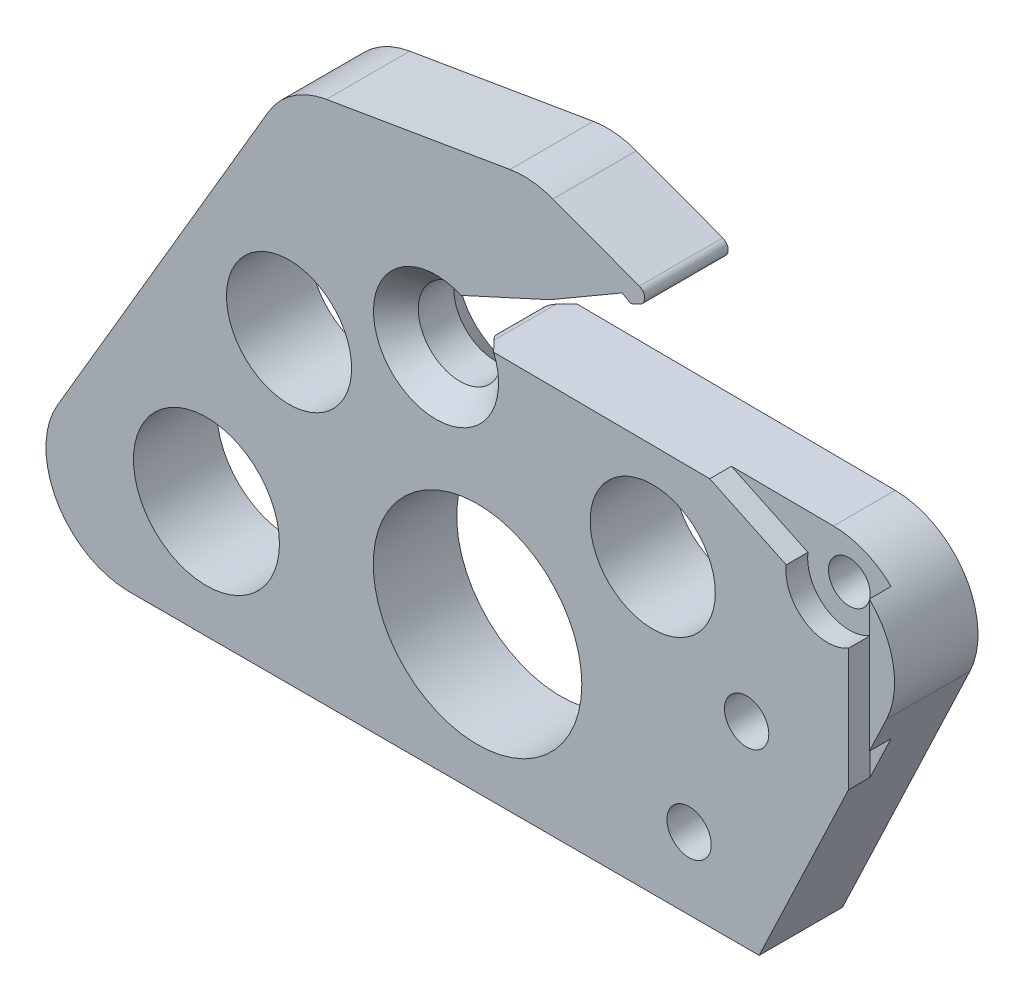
ISO-10303-21;
HEADER;
FILE_DESCRIPTION(('STEP AP214'),'2;1');
FILE_NAME('part.step','',(''),(''),'','','');
FILE_SCHEMA(('AUTOMOTIVE_DESIGN { 1 0 10303 214 1 1 1 1 }'));
ENDSEC;
DATA;
#1=APPLICATION_CONTEXT('core data for automotive mechanical design processes');
#2=APPLICATION_PROTOCOL_DEFINITION('international standard','automotive_design',2000,#1);
#3=PRODUCT_CONTEXT('',#1,'mechanical');
#4=PRODUCT('Part','Part','',(#3));
#5=PRODUCT_RELATED_PRODUCT_CATEGORY('part','',(#4));
#6=PRODUCT_DEFINITION_FORMATION('','',#4);
#7=PRODUCT_DEFINITION_CONTEXT('part definition',#1,'design');
#8=PRODUCT_DEFINITION('design','',#6,#7);
#9=PRODUCT_DEFINITION_SHAPE('','',#8);
#10=(LENGTH_UNIT() NAMED_UNIT(*) SI_UNIT(.MILLI.,.METRE.));
#11=(NAMED_UNIT(*) PLANE_ANGLE_UNIT() SI_UNIT($,.RADIAN.));
#12=(NAMED_UNIT(*) SI_UNIT($,.STERADIAN.) SOLID_ANGLE_UNIT());
#13=UNCERTAINTY_MEASURE_WITH_UNIT(LENGTH_MEASURE(1.E-05),#10,'distance_accuracy_value','');
#14=(GEOMETRIC_REPRESENTATION_CONTEXT(3) GLOBAL_UNCERTAINTY_ASSIGNED_CONTEXT((#13)) GLOBAL_UNIT_ASSIGNED_CONTEXT((#10,
#11,#12)) REPRESENTATION_CONTEXT('',''));
#15=CARTESIAN_POINT('',(0.,0.,0.));
#16=DIRECTION('',(0.,0.,1.));
#17=DIRECTION('',(1.,0.,0.));
#18=AXIS2_PLACEMENT_3D('',#15,#16,#17);
#19=CARTESIAN_POINT('',(66.2224018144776,100.540264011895,6.35));
#20=DIRECTION('',(0.,0.,-1.));
#21=DIRECTION('',(-1.,0.,0.));
#22=AXIS2_PLACEMENT_3D('',#19,#20,#21);
#23=CYLINDRICAL_SURFACE('',#22,12.7);
#24=DIRECTION('',(0.,0.,-1.));
#25=VECTOR('',#24,1.);
#26=CARTESIAN_POINT('',(66.3129398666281,113.239941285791,6.35));
#27=LINE('',#26,#25);
#28=CARTESIAN_POINT('',(66.3129398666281,113.239941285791,3.048));
#29=VERTEX_POINT('',#28);
#30=CARTESIAN_POINT('',(66.3129398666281,113.239941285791,-6.35));
#31=VERTEX_POINT('',#30);
#32=EDGE_CURVE('E241',#29,#31,#27,.T.);
#33=ORIENTED_EDGE('',*,*,#32,.F.);
#34=CARTESIAN_POINT('',(66.2224018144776,100.540264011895,3.048));
#35=DIRECTION('',(0.,0.,1.));
#36=DIRECTION('',(1.,0.,0.));
#37=AXIS2_PLACEMENT_3D('',#34,#35,#36);
#38=CIRCLE('',#37,12.7);
#39=CARTESIAN_POINT('',(75.0754912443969,109.64591102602,3.048));
#40=VERTEX_POINT('',#39);
#41=EDGE_CURVE('E395',#29,#40,#38,.F.);
#42=ORIENTED_EDGE('',*,*,#41,.T.);
#43=DIRECTION('',(0.,0.,-1.));
#44=VECTOR('',#43,1.);
#45=CARTESIAN_POINT('',(75.0754912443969,109.64591102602,6.35));
#46=LINE('',#45,#44);
#47=CARTESIAN_POINT('',(75.0754912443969,109.64591102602,6.35));
#48=VERTEX_POINT('',#47);
#49=EDGE_CURVE('E526',#48,#40,#46,.T.);
#50=ORIENTED_EDGE('',*,*,#49,.F.);
#51=CARTESIAN_POINT('',(66.2224018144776,100.540264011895,6.35));
#52=DIRECTION('',(0.,0.,-1.));
#53=DIRECTION('',(-1.,0.,0.));
#54=AXIS2_PLACEMENT_3D('',#51,#52,#53);
#55=CIRCLE('',#54,12.7);
#56=CARTESIAN_POINT('',(77.6939551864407,95.0910931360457,6.35));
#57=VERTEX_POINT('',#56);
#58=EDGE_CURVE('E254',#57,#48,#55,.F.);
#59=ORIENTED_EDGE('',*,*,#58,.F.);
#60=DIRECTION('',(0.,0.,-1.));
#61=VECTOR('',#60,1.);
#62=CARTESIAN_POINT('',(77.6939551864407,95.0910931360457,6.35));
#63=LINE('',#62,#61);
#64=CARTESIAN_POINT('',(77.6939551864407,95.0910931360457,-6.35));
#65=VERTEX_POINT('',#64);
#66=EDGE_CURVE('E249',#65,#57,#63,.F.);
#67=ORIENTED_EDGE('',*,*,#66,.F.);
#68=CARTESIAN_POINT('',(66.2224018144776,100.540264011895,-6.35));
#69=DIRECTION('',(0.,0.,-1.));
#70=DIRECTION('',(-1.,0.,0.));
#71=AXIS2_PLACEMENT_3D('',#68,#69,#70);
#72=CIRCLE('',#71,12.7);
#73=EDGE_CURVE('E246',#31,#65,#72,.T.);
#74=ORIENTED_EDGE('',*,*,#73,.F.);
#75=EDGE_LOOP('',(#33,#42,#50,#59,#67,#74));
#76=FACE_BOUND('',#75,.T.);
#77=ADVANCED_FACE('F32',(#76),#23,.T.);
#78=CARTESIAN_POINT('',(9.10147894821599,109.867298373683,6.35));
#79=DIRECTION('',(0.,0.,-1.));
#80=DIRECTION('',(-1.,0.,0.));
#81=AXIS2_PLACEMENT_3D('',#78,#79,#80);
#82=PLANE('',#81);
#83=CARTESIAN_POINT('',(47.6304052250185,65.1817278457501,6.35));
#84=DIRECTION('',(0.,0.,1.));
#85=DIRECTION('',(1.,0.,0.));
#86=AXIS2_PLACEMENT_3D('',#83,#84,#85);
#87=CIRCLE('',#86,3.37312);
#88=CARTESIAN_POINT('',(51.0035252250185,65.1817278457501,6.35));
#89=VERTEX_POINT('',#88);
#90=EDGE_CURVE('E583',#89,#89,#87,.T.);
#91=ORIENTED_EDGE('',*,*,#90,.F.);
#92=EDGE_LOOP('',(#91));
#93=FACE_BOUND('',#92,.T.);
#94=CARTESIAN_POINT('',(56.3934052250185,84.1555278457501,6.35));
#95=DIRECTION('',(0.,0.,1.));
#96=DIRECTION('',(1.,0.,0.));
#97=AXIS2_PLACEMENT_3D('',#94,#95,#96);
#98=CIRCLE('',#97,3.37311999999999);
#99=CARTESIAN_POINT('',(59.7665252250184,84.1555278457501,6.35));
#100=VERTEX_POINT('',#99);
#101=EDGE_CURVE('E577',#100,#100,#98,.T.);
#102=ORIENTED_EDGE('',*,*,#101,.F.);
#103=EDGE_LOOP('',(#102));
#104=FACE_BOUND('',#103,.T.);
#105=CARTESIAN_POINT('',(42.0924018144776,98.7097278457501,6.35));
#106=DIRECTION('',(0.,0.,1.));
#107=DIRECTION('',(1.,0.,0.));
#108=AXIS2_PLACEMENT_3D('',#105,#106,#107);
#109=CIRCLE('',#108,9.525);
#110=CARTESIAN_POINT('',(51.6174018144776,98.7097278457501,6.35));
#111=VERTEX_POINT('',#110);
#112=EDGE_CURVE('E571',#111,#111,#109,.T.);
#113=ORIENTED_EDGE('',*,*,#112,.F.);
#114=EDGE_LOOP('',(#113));
#115=FACE_BOUND('',#114,.T.);
#116=CARTESIAN_POINT('',(-25.8525981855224,72.0397278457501,6.35));
#117=DIRECTION('',(0.,0.,1.));
#118=DIRECTION('',(1.,0.,0.));
#119=AXIS2_PLACEMENT_3D('',#116,#117,#118);
#120=CIRCLE('',#119,11.1125);
#121=CARTESIAN_POINT('',(-14.7400981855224,72.0397278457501,6.35));
#122=VERTEX_POINT('',#121);
#123=EDGE_CURVE('E565',#122,#122,#120,.T.);
#124=ORIENTED_EDGE('',*,*,#123,.F.);
#125=EDGE_LOOP('',(#124));
#126=FACE_BOUND('',#125,.T.);
#127=CARTESIAN_POINT('',(15.4224018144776,76.4847278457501,6.35));
#128=DIRECTION('',(0.,0.,1.));
#129=DIRECTION('',(1.,0.,0.));
#130=AXIS2_PLACEMENT_3D('',#127,#128,#129);
#131=CIRCLE('',#130,15.875);
#132=CARTESIAN_POINT('',(31.2974018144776,76.4847278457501,6.35));
#133=VERTEX_POINT('',#132);
#134=EDGE_CURVE('E559',#133,#133,#131,.T.);
#135=ORIENTED_EDGE('',*,*,#134,.F.);
#136=EDGE_LOOP('',(#135));
#137=FACE_BOUND('',#136,.T.);
#138=CARTESIAN_POINT('',(-13.2780510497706,100.655204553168,6.35));
#139=DIRECTION('',(0.,0.,1.));
#140=DIRECTION('',(1.,0.,0.));
#141=AXIS2_PLACEMENT_3D('',#138,#139,#140);
#142=CIRCLE('',#141,9.52500000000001);
#143=CARTESIAN_POINT('',(-3.75305104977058,100.655204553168,6.35));
#144=VERTEX_POINT('',#143);
#145=EDGE_CURVE('E356',#144,#144,#142,.T.);
#146=ORIENTED_EDGE('',*,*,#145,.F.);
#147=EDGE_LOOP('',(#146));
#148=FACE_BOUND('',#147,.T.);
#149=DIRECTION('',(-0.50616117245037,-0.862438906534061,0.));
#150=VECTOR('',#149,1.);
#151=CARTESIAN_POINT('',(-53.3406262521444,65.2127019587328,6.35));
#152=LINE('',#151,#150);
#153=CARTESIAN_POINT('',(-16.4332488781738,128.098517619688,6.35));
#154=VERTEX_POINT('',#153);
#155=CARTESIAN_POINT('',(-48.5425986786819,73.3879747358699,6.35));
#156=VERTEX_POINT('',#155);
#157=EDGE_CURVE('E229',#154,#156,#152,.T.);
#158=ORIENTED_EDGE('',*,*,#157,.T.);
#159=CARTESIAN_POINT('',(-37.5896245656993,66.9597278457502,6.35));
#160=DIRECTION('',(0.,0.,-1.));
#161=DIRECTION('',(-1.,0.,0.));
#162=AXIS2_PLACEMENT_3D('',#159,#160,#161);
#163=CIRCLE('',#162,12.7);
#164=CARTESIAN_POINT('',(-37.5896245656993,54.2597278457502,6.35));
#165=VERTEX_POINT('',#164);
#166=EDGE_CURVE('E11',#156,#165,#163,.F.);
#167=ORIENTED_EDGE('',*,*,#166,.T.);
#168=DIRECTION('',(-1.,0.,0.));
#169=VECTOR('',#168,1.);
#170=CARTESIAN_POINT('',(-59.7688731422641,54.2597278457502,6.35));
#171=LINE('',#170,#169);
#172=CARTESIAN_POINT('',(58.2984052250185,54.2597278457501,6.35));
#173=VERTEX_POINT('',#172);
#174=EDGE_CURVE('E203',#173,#165,#171,.T.);
#175=ORIENTED_EDGE('',*,*,#174,.F.);
#176=DIRECTION('',(0.4290685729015,0.903271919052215,0.));
#177=VECTOR('',#176,1.);
#178=CARTESIAN_POINT('',(86.2474401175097,113.09782501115,6.35));
#179=LINE('',#178,#177);
#180=CARTESIAN_POINT('',(71.9004912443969,82.8947366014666,6.35));
#181=VERTEX_POINT('',#180);
#182=EDGE_CURVE('E215',#173,#181,#179,.T.);
#183=ORIENTED_EDGE('',*,*,#182,.T.);
#184=DIRECTION('',(0.,-1.,0.));
#185=VECTOR('',#184,1.);
#186=CARTESIAN_POINT('',(71.9004912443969,119.761365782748,6.35));
#187=LINE('',#186,#185);
#188=CARTESIAN_POINT('',(71.9004912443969,101.562104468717,6.35));
#189=VERTEX_POINT('',#188);
#190=EDGE_CURVE('E540',#189,#181,#187,.T.);
#191=ORIENTED_EDGE('',*,*,#190,.F.);
#192=CARTESIAN_POINT('',(68.7254912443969,107.061365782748,6.35));
#193=DIRECTION('',(0.,0.,1.));
#194=DIRECTION('',(1.,0.,0.));
#195=AXIS2_PLACEMENT_3D('',#192,#193,#194);
#196=CIRCLE('',#195,6.34999999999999);
#197=CARTESIAN_POINT('',(62.4207743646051,107.81836318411,6.35));
#198=VERTEX_POINT('',#197);
#199=EDGE_CURVE('E401',#198,#189,#196,.T.);
#200=ORIENTED_EDGE('',*,*,#199,.F.);
#201=DIRECTION('',(0.903271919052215,-0.429068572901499,0.));
#202=VECTOR('',#201,1.);
#203=CARTESIAN_POINT('',(50.7740981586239,113.350720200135,6.35));
#204=LINE('',#203,#202);
#205=CARTESIAN_POINT('',(50.7740981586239,113.350720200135,6.35));
#206=VERTEX_POINT('',#205);
#207=EDGE_CURVE('E552',#206,#198,#204,.T.);
#208=ORIENTED_EDGE('',*,*,#207,.F.);
#209=DIRECTION('',(-0.999974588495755,0.00712898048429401,0.));
#210=VECTOR('',#209,1.);
#211=CARTESIAN_POINT('',(14.2303533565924,113.611246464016,6.35));
#212=LINE('',#211,#210);
#213=CARTESIAN_POINT('',(17.8708656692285,113.585292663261,6.35));
#214=VERTEX_POINT('',#213);
#215=EDGE_CURVE('E224',#206,#214,#212,.T.);
#216=ORIENTED_EDGE('',*,*,#215,.T.);
#217=CARTESIAN_POINT('',(9.101478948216,109.867298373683,6.35));
#218=DIRECTION('',(0.,0.,-1.));
#219=DIRECTION('',(-1.,0.,0.));
#220=AXIS2_PLACEMENT_3D('',#217,#218,#219);
#221=CIRCLE('',#220,9.52500000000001);
#222=CARTESIAN_POINT('',(12.9145215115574,118.595776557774,6.35));
#223=VERTEX_POINT('',#222);
#224=EDGE_CURVE('E427',#214,#223,#221,.T.);
#225=ORIENTED_EDGE('',*,*,#224,.T.);
#226=DIRECTION('',(0.909297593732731,0.416146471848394,0.));
#227=VECTOR('',#226,1.);
#228=CARTESIAN_POINT('',(42.9290758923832,132.332149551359,6.35));
#229=LINE('',#228,#227);
#230=CARTESIAN_POINT('',(26.4557000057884,124.792992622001,6.35));
#231=VERTEX_POINT('',#230);
#232=EDGE_CURVE('E378',#223,#231,#229,.T.);
#233=ORIENTED_EDGE('',*,*,#232,.T.);
#234=DIRECTION('',(-0.864354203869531,-0.502883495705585,0.));
#235=VECTOR('',#234,1.);
#236=CARTESIAN_POINT('',(37.4329983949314,131.179613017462,6.35));
#237=LINE('',#236,#235);
#238=CARTESIAN_POINT('',(37.4329983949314,131.179613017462,6.35));
#239=VERTEX_POINT('',#238);
#240=EDGE_CURVE('E415',#239,#231,#237,.T.);
#241=ORIENTED_EDGE('',*,*,#240,.F.);
#242=DIRECTION('',(-0.867686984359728,0.497110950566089,0.));
#243=VECTOR('',#242,1.);
#244=CARTESIAN_POINT('',(38.7553533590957,130.422015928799,6.35));
#245=LINE('',#244,#243);
#246=CARTESIAN_POINT('',(38.7553533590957,130.422015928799,6.35));
#247=VERTEX_POINT('',#246);
#248=EDGE_CURVE('E412',#247,#239,#245,.T.);
#249=ORIENTED_EDGE('',*,*,#248,.F.);
#250=CARTESIAN_POINT('',(40.1411228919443,131.056223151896,6.35));
#251=VERTEX_POINT('',#250);
#252=EDGE_CURVE('E377',#247,#251,#229,.T.);
#253=ORIENTED_EDGE('',*,*,#252,.T.);
#254=CARTESIAN_POINT('',(39.6126168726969,132.211031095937,6.35));
#255=DIRECTION('',(0.,0.,-1.));
#256=DIRECTION('',(-1.,0.,0.));
#257=AXIS2_PLACEMENT_3D('',#254,#255,#256);
#258=CIRCLE('',#257,1.27);
#259=CARTESIAN_POINT('',(40.0554792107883,133.401313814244,6.35));
#260=VERTEX_POINT('',#259);
#261=EDGE_CURVE('E272',#251,#260,#258,.F.);
#262=ORIENTED_EDGE('',*,*,#261,.T.);
#263=DIRECTION('',(-0.937230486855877,0.348710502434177,0.));
#264=VECTOR('',#263,1.);
#265=CARTESIAN_POINT('',(23.7096974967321,139.48300432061,6.35));
#266=LINE('',#265,#264);
#267=CARTESIAN_POINT('',(26.8990504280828,138.296358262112,6.35));
#268=VERTEX_POINT('',#267);
#269=EDGE_CURVE('E381',#260,#268,#266,.T.);
#270=ORIENTED_EDGE('',*,*,#269,.T.);
#271=CARTESIAN_POINT('',(22.4704270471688,126.393531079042,6.35));
#272=DIRECTION('',(0.,0.,-1.));
#273=DIRECTION('',(-1.,0.,0.));
#274=AXIS2_PLACEMENT_3D('',#271,#272,#273);
#275=CIRCLE('',#274,12.7);
#276=CARTESIAN_POINT('',(20.3543138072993,138.915993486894,6.35));
#277=VERTEX_POINT('',#276);
#278=EDGE_CURVE('E252',#268,#277,#275,.F.);
#279=ORIENTED_EDGE('',*,*,#278,.T.);
#280=DIRECTION('',(-0.986020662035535,-0.166623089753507,0.));
#281=VECTOR('',#280,1.);
#282=CARTESIAN_POINT('',(-7.5963880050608,134.19273313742,6.35));
#283=LINE('',#282,#281);
#284=CARTESIAN_POINT('',(-7.5963880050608,134.19273313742,6.35));
#285=VERTEX_POINT('',#284);
#286=EDGE_CURVE('E383',#277,#285,#283,.T.);
#287=ORIENTED_EDGE('',*,*,#286,.T.);
#288=CARTESIAN_POINT('',(-5.48027476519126,121.670270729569,6.35));
#289=DIRECTION('',(0.,0.,1.));
#290=DIRECTION('',(-1.,0.,0.));
#291=AXIS2_PLACEMENT_3D('',#288,#289,#290);
#292=CIRCLE('',#291,12.7);
#293=EDGE_CURVE('E384',#285,#154,#292,.T.);
#294=ORIENTED_EDGE('',*,*,#293,.T.);
#295=EDGE_LOOP('',(#158,#167,#175,#183,#191,#200,#208,#216,#225,#233,#241,#249,#253,#262,#270,
#279,#287,#294));
#296=FACE_BOUND('',#295,.T.);
#297=ADVANCED_FACE('F213',(#93,#104,#115,#126,#137,#148,#296),#82,.F.);
#298=CARTESIAN_POINT('',(68.7254912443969,107.061365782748,-6.35));
#299=DIRECTION('',(0.,0.,1.));
#300=DIRECTION('',(1.,0.,0.));
#301=AXIS2_PLACEMENT_3D('',#298,#299,#300);
#302=CYLINDRICAL_SURFACE('',#301,3.175);
#303=CARTESIAN_POINT('',(68.7254912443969,107.061365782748,-6.35));
#304=DIRECTION('',(0.,0.,1.));
#305=DIRECTION('',(1.,0.,0.));
#306=AXIS2_PLACEMENT_3D('',#303,#304,#305);
#307=CIRCLE('',#306,3.175);
#308=CARTESIAN_POINT('',(71.9004912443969,107.061365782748,-6.35));
#309=VERTEX_POINT('',#308);
#310=EDGE_CURVE('E399',#309,#309,#307,.T.);
#311=ORIENTED_EDGE('',*,*,#310,.F.);
#312=EDGE_LOOP('',(#311));
#313=FACE_BOUND('',#312,.T.);
#314=CARTESIAN_POINT('',(68.7254912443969,107.061365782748,3.048));
#315=DIRECTION('',(0.,0.,1.));
#316=DIRECTION('',(1.,0.,0.));
#317=AXIS2_PLACEMENT_3D('',#314,#315,#316);
#318=CIRCLE('',#317,3.175);
#319=CARTESIAN_POINT('',(71.9004912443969,107.061365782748,3.048));
#320=VERTEX_POINT('',#319);
#321=EDGE_CURVE('E393',#320,#320,#318,.F.);
#322=ORIENTED_EDGE('',*,*,#321,.F.);
#323=EDGE_LOOP('',(#322));
#324=FACE_BOUND('',#323,.T.);
#325=ADVANCED_FACE('F503',(#313,#324),#302,.F.);
#326=CARTESIAN_POINT('',(42.9290758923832,132.332149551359,6.35));
#327=DIRECTION('',(-0.416146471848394,0.909297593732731,0.));
#328=DIRECTION('',(-0.909297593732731,-0.416146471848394,0.));
#329=AXIS2_PLACEMENT_3D('',#326,#327,#328);
#330=PLANE('',#329);
#331=DIRECTION('',(0.909297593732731,0.416146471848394,0.));
#332=VECTOR('',#331,1.);
#333=CARTESIAN_POINT('',(42.9290758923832,132.332149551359,-6.35));
#334=LINE('',#333,#332);
#335=CARTESIAN_POINT('',(12.9145215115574,118.595776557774,-6.35));
#336=VERTEX_POINT('',#335);
#337=CARTESIAN_POINT('',(26.4557000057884,124.792992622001,-6.35));
#338=VERTEX_POINT('',#337);
#339=EDGE_CURVE('E360',#336,#338,#334,.T.);
#340=ORIENTED_EDGE('',*,*,#339,.T.);
#341=DIRECTION('',(0.,0.,1.));
#342=VECTOR('',#341,1.);
#343=CARTESIAN_POINT('',(26.4557000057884,124.792992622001,-6.35));
#344=LINE('',#343,#342);
#345=EDGE_CURVE('E424',#338,#231,#344,.T.);
#346=ORIENTED_EDGE('',*,*,#345,.T.);
#347=ORIENTED_EDGE('',*,*,#232,.F.);
#348=CARTESIAN_POINT('',(6.4587488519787,115.641246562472,2.69758031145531));
#349=CARTESIAN_POINT('',(6.53347154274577,115.675443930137,2.69757178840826));
#350=CARTESIAN_POINT('',(6.60818401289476,115.709636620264,2.69940962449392));
#351=CARTESIAN_POINT('',(6.75745194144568,115.777950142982,2.70672780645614));
#352=CARTESIAN_POINT('',(6.83200741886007,115.812070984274,2.71220768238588));
#353=CARTESIAN_POINT('',(7.05497738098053,115.914114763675,2.73400792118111));
#354=CARTESIAN_POINT('',(7.20298260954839,115.981850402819,2.75568927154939));
#355=CARTESIAN_POINT('',(7.49438748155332,116.115213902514,2.81190324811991));
#356=CARTESIAN_POINT('',(7.63782280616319,116.180858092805,2.84621714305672));
#357=CARTESIAN_POINT('',(7.92203577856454,116.310930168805,2.92640228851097));
#358=CARTESIAN_POINT('',(8.06281215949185,116.375357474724,2.97227890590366));
#359=CARTESIAN_POINT('',(8.43563184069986,116.545981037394,3.10858938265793));
#360=CARTESIAN_POINT('',(8.6649182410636,116.65091557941,3.20815789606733));
#361=CARTESIAN_POINT('',(9.11470239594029,116.856762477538,3.42892403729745));
#362=CARTESIAN_POINT('',(9.33519269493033,116.957671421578,3.55013955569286));
#363=CARTESIAN_POINT('',(9.77097955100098,117.157112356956,3.81045325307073));
#364=CARTESIAN_POINT('',(9.98616800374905,117.255594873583,3.94976786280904));
#365=CARTESIAN_POINT('',(10.4093493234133,117.449266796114,4.24075941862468));
#366=CARTESIAN_POINT('',(10.617344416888,117.544457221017,4.39243248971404));
#367=CARTESIAN_POINT('',(11.0064449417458,117.722531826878,4.6892222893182));
#368=CARTESIAN_POINT('',(11.1881286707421,117.805680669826,4.83342902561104));
#369=CARTESIAN_POINT('',(11.5474305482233,117.970117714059,5.12785654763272));
#370=CARTESIAN_POINT('',(11.7250483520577,118.051405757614,5.27807784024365));
#371=CARTESIAN_POINT('',(12.0729249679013,118.210613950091,5.57992846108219));
#372=CARTESIAN_POINT('',(12.2432596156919,118.288568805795,5.73145254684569));
#373=CARTESIAN_POINT('',(12.5810337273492,118.443153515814,6.03822355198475));
#374=CARTESIAN_POINT('',(12.7484742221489,118.519783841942,6.19346909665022));
#375=CARTESIAN_POINT('',(12.9147336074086,118.59587362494,6.3502));
#376=B_SPLINE_CURVE_WITH_KNOTS('',3,(#348,#349,#350,#351,#352,#353,#354,#355,#356,#357,#358,
#359,#360,#361,#362,#363,#364,#365,#366,#367,#368,#369,#370,#371,#372,#373,#374,#375),
.UNSPECIFIED.,.F.,.F.,(4,2,2,2,2,2,2,2,2,2,2,2,2,4),(0.,0.246486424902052,0.492941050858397,
0.984906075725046,1.4687253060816,1.95276951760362,2.76462225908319,3.57714910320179,
4.40048439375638,5.22356251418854,5.96266194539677,6.70182379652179,7.42458092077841,
8.1470750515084),.UNSPECIFIED.);
#377=CARTESIAN_POINT('',(6.45894885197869,115.641338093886,2.69758030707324));
#378=VERTEX_POINT('',#377);
#379=EDGE_CURVE('E346',#378,#223,#376,.T.);
#380=ORIENTED_EDGE('',*,*,#379,.F.);
#381=DIRECTION('',(0.,0.,-1.));
#382=VECTOR('',#381,1.);
#383=CARTESIAN_POINT('',(6.4589488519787,115.641338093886,6.35));
#384=LINE('',#383,#382);
#385=CARTESIAN_POINT('',(6.45894885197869,115.641338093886,-2.69758030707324));
#386=VERTEX_POINT('',#385);
#387=EDGE_CURVE('E227',#378,#386,#384,.T.);
#388=ORIENTED_EDGE('',*,*,#387,.T.);
#389=CARTESIAN_POINT('',(12.9147336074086,118.59587362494,-6.3502));
#390=CARTESIAN_POINT('',(12.7438811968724,118.517681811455,-6.18914420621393));
#391=CARTESIAN_POINT('',(12.5717830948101,118.438919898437,-6.02965179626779));
#392=CARTESIAN_POINT('',(12.2245025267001,118.279984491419,-5.71460406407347));
#393=CARTESIAN_POINT('',(12.0493186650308,118.199810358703,-5.55905060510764));
#394=CARTESIAN_POINT('',(11.6932201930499,118.036839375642,-5.25092909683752));
#395=CARTESIAN_POINT('',(11.512261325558,117.954022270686,-5.09842264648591));
#396=CARTESIAN_POINT('',(11.1460949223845,117.786443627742,-4.79974471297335));
#397=CARTESIAN_POINT('',(10.9608880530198,117.701682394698,-4.653572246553));
#398=CARTESIAN_POINT('',(10.595951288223,117.53466650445,-4.37722957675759));
#399=CARTESIAN_POINT('',(10.4164968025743,117.452537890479,-4.24662167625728));
#400=CARTESIAN_POINT('',(10.0523002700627,117.285860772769,-3.99446785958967));
#401=CARTESIAN_POINT('',(9.86755698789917,117.201311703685,-3.87292408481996));
#402=CARTESIAN_POINT('',(9.49293629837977,117.029863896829,-3.642042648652));
#403=CARTESIAN_POINT('',(9.3030864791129,116.942977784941,-3.53265131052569));
#404=CARTESIAN_POINT('',(8.91692195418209,116.766246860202,-3.32881293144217));
#405=CARTESIAN_POINT('',(8.72061178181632,116.676404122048,-3.23435567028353));
#406=CARTESIAN_POINT('',(8.3583727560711,116.510622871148,-3.08023522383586));
#407=CARTESIAN_POINT('',(8.1935774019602,116.435203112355,-3.01736812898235));
#408=CARTESIAN_POINT('',(7.85981932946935,116.282456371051,-2.90674040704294));
#409=CARTESIAN_POINT('',(7.69085819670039,116.205130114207,-2.85897412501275));
#410=CARTESIAN_POINT('',(7.43316314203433,116.087194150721,-2.80003102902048));
#411=CARTESIAN_POINT('',(7.34562730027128,116.047132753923,-2.78238710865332));
#412=CARTESIAN_POINT('',(7.16986126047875,115.966692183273,-2.75191577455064));
#413=CARTESIAN_POINT('',(7.08163109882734,115.92631302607,-2.739088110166));
#414=CARTESIAN_POINT('',(6.90443064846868,115.845215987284,-2.71843752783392));
#415=CARTESIAN_POINT('',(6.81545896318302,115.804497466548,-2.71062906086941));
#416=CARTESIAN_POINT('',(6.63724295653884,115.722935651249,-2.70018997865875));
#417=CARTESIAN_POINT('',(6.54799857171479,115.682092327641,-2.69756067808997));
#418=CARTESIAN_POINT('',(6.4587488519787,115.641246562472,-2.69758031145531));
#419=B_SPLINE_CURVE_WITH_KNOTS('',3,(#389,#390,#391,#392,#393,#394,#395,#396,#397,#398,#399,
#400,#401,#402,#403,#404,#405,#406,#407,#408,#409,#410,#411,#412,#413,#414,#415,#416,#417,#418),
.UNSPECIFIED.,.F.,.F.,(4,2,2,2,2,2,2,2,2,2,2,2,2,2,4),(0.,0.742447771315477,1.48524042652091,
2.23731540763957,2.98927321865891,3.69905685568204,4.40900765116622,5.11568623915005,
5.82187909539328,6.39683810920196,6.97158155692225,7.26509283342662,7.55858883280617,
7.85292610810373,8.14733808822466),.UNSPECIFIED.);
#420=EDGE_CURVE('E321',#336,#386,#419,.T.);
#421=ORIENTED_EDGE('',*,*,#420,.F.);
#422=EDGE_LOOP('',(#340,#346,#347,#380,#388,#421));
#423=FACE_BOUND('',#422,.T.);
#424=ADVANCED_FACE('F449',(#423),#330,.F.);
#425=ORIENTED_EDGE('',*,*,#58,.T.);
#426=DIRECTION('',(0.,1.,0.));
#427=VECTOR('',#426,1.);
#428=CARTESIAN_POINT('',(75.0754912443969,119.761365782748,6.35));
#429=LINE('',#428,#427);
#430=CARTESIAN_POINT('',(75.0754912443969,89.5787226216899,6.35));
#431=VERTEX_POINT('',#430);
#432=EDGE_CURVE('E520',#431,#48,#429,.T.);
#433=ORIENTED_EDGE('',*,*,#432,.F.);
#434=EDGE_CURVE('E225',#431,#57,#179,.T.);
#435=ORIENTED_EDGE('',*,*,#434,.T.);
#436=EDGE_LOOP('',(#425,#433,#435));
#437=FACE_BOUND('',#436,.T.);
#438=ADVANCED_FACE('F505',(#437),#82,.F.);
#439=CARTESIAN_POINT('',(9.10147894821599,109.867298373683,-6.35));
#440=DIRECTION('',(0.,0.,-1.));
#441=DIRECTION('',(-1.,0.,0.));
#442=AXIS2_PLACEMENT_3D('',#439,#440,#441);
#443=PLANE('',#442);
#444=CARTESIAN_POINT('',(47.6304052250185,65.1817278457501,-6.35));
#445=DIRECTION('',(0.,0.,1.));
#446=DIRECTION('',(1.,0.,0.));
#447=AXIS2_PLACEMENT_3D('',#444,#445,#446);
#448=CIRCLE('',#447,3.37312);
#449=CARTESIAN_POINT('',(51.0035252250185,65.1817278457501,-6.35));
#450=VERTEX_POINT('',#449);
#451=EDGE_CURVE('E580',#450,#450,#448,.T.);
#452=ORIENTED_EDGE('',*,*,#451,.T.);
#453=EDGE_LOOP('',(#452));
#454=FACE_BOUND('',#453,.T.);
#455=CARTESIAN_POINT('',(56.3934052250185,84.1555278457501,-6.35));
#456=DIRECTION('',(0.,0.,1.));
#457=DIRECTION('',(1.,0.,0.));
#458=AXIS2_PLACEMENT_3D('',#455,#456,#457);
#459=CIRCLE('',#458,3.37311999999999);
#460=CARTESIAN_POINT('',(59.7665252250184,84.1555278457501,-6.35));
#461=VERTEX_POINT('',#460);
#462=EDGE_CURVE('E574',#461,#461,#459,.T.);
#463=ORIENTED_EDGE('',*,*,#462,.T.);
#464=EDGE_LOOP('',(#463));
#465=FACE_BOUND('',#464,.T.);
#466=CARTESIAN_POINT('',(42.0924018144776,98.7097278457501,-6.35));
#467=DIRECTION('',(0.,0.,1.));
#468=DIRECTION('',(1.,0.,0.));
#469=AXIS2_PLACEMENT_3D('',#466,#467,#468);
#470=CIRCLE('',#469,9.525);
#471=CARTESIAN_POINT('',(51.6174018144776,98.7097278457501,-6.35));
#472=VERTEX_POINT('',#471);
#473=EDGE_CURVE('E568',#472,#472,#470,.T.);
#474=ORIENTED_EDGE('',*,*,#473,.T.);
#475=EDGE_LOOP('',(#474));
#476=FACE_BOUND('',#475,.T.);
#477=CARTESIAN_POINT('',(-25.8525981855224,72.0397278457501,-6.35));
#478=DIRECTION('',(0.,0.,1.));
#479=DIRECTION('',(1.,0.,0.));
#480=AXIS2_PLACEMENT_3D('',#477,#478,#479);
#481=CIRCLE('',#480,11.1125);
#482=CARTESIAN_POINT('',(-14.7400981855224,72.0397278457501,-6.35));
#483=VERTEX_POINT('',#482);
#484=EDGE_CURVE('E562',#483,#483,#481,.T.);
#485=ORIENTED_EDGE('',*,*,#484,.T.);
#486=EDGE_LOOP('',(#485));
#487=FACE_BOUND('',#486,.T.);
#488=CARTESIAN_POINT('',(15.4224018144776,76.4847278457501,-6.35));
#489=DIRECTION('',(0.,0.,1.));
#490=DIRECTION('',(1.,0.,0.));
#491=AXIS2_PLACEMENT_3D('',#488,#489,#490);
#492=CIRCLE('',#491,15.875);
#493=CARTESIAN_POINT('',(31.2974018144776,76.4847278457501,-6.35));
#494=VERTEX_POINT('',#493);
#495=EDGE_CURVE('E218',#494,#494,#492,.T.);
#496=ORIENTED_EDGE('',*,*,#495,.T.);
#497=EDGE_LOOP('',(#496));
#498=FACE_BOUND('',#497,.T.);
#499=DIRECTION('',(-1.,0.,0.));
#500=VECTOR('',#499,1.);
#501=CARTESIAN_POINT('',(-59.7688731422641,54.2597278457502,-6.35));
#502=LINE('',#501,#500);
#503=CARTESIAN_POINT('',(58.2984052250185,54.2597278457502,-6.35));
#504=VERTEX_POINT('',#503);
#505=CARTESIAN_POINT('',(-37.5896245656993,54.2597278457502,-6.35));
#506=VERTEX_POINT('',#505);
#507=EDGE_CURVE('E205',#504,#506,#502,.T.);
#508=ORIENTED_EDGE('',*,*,#507,.T.);
#509=CARTESIAN_POINT('',(-37.5896245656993,66.9597278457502,-6.35));
#510=DIRECTION('',(0.,0.,-1.));
#511=DIRECTION('',(-1.,0.,0.));
#512=AXIS2_PLACEMENT_3D('',#509,#510,#511);
#513=CIRCLE('',#512,12.7);
#514=CARTESIAN_POINT('',(-48.5425986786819,73.3879747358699,-6.35));
#515=VERTEX_POINT('',#514);
#516=EDGE_CURVE('E55',#506,#515,#513,.T.);
#517=ORIENTED_EDGE('',*,*,#516,.T.);
#518=DIRECTION('',(-0.50616117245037,-0.862438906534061,0.));
#519=VECTOR('',#518,1.);
#520=CARTESIAN_POINT('',(-53.3406262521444,65.2127019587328,-6.35));
#521=LINE('',#520,#519);
#522=CARTESIAN_POINT('',(-16.4332488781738,128.098517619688,-6.35));
#523=VERTEX_POINT('',#522);
#524=EDGE_CURVE('E370',#523,#515,#521,.T.);
#525=ORIENTED_EDGE('',*,*,#524,.F.);
#526=CARTESIAN_POINT('',(-5.48027476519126,121.670270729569,-6.35));
#527=DIRECTION('',(0.,0.,1.));
#528=DIRECTION('',(-1.,0.,0.));
#529=AXIS2_PLACEMENT_3D('',#526,#527,#528);
#530=CIRCLE('',#529,12.7);
#531=CARTESIAN_POINT('',(-7.5963880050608,134.19273313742,-6.35));
#532=VERTEX_POINT('',#531);
#533=EDGE_CURVE('E367',#532,#523,#530,.T.);
#534=ORIENTED_EDGE('',*,*,#533,.F.);
#535=DIRECTION('',(-0.986020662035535,-0.166623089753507,0.));
#536=VECTOR('',#535,1.);
#537=CARTESIAN_POINT('',(-7.5963880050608,134.19273313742,-6.35));
#538=LINE('',#537,#536);
#539=CARTESIAN_POINT('',(20.3543138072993,138.915993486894,-6.35));
#540=VERTEX_POINT('',#539);
#541=EDGE_CURVE('E365',#540,#532,#538,.T.);
#542=ORIENTED_EDGE('',*,*,#541,.F.);
#543=CARTESIAN_POINT('',(22.4704270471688,126.393531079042,-6.35));
#544=DIRECTION('',(0.,0.,-1.));
#545=DIRECTION('',(-1.,0.,0.));
#546=AXIS2_PLACEMENT_3D('',#543,#544,#545);
#547=CIRCLE('',#546,12.7);
#548=CARTESIAN_POINT('',(26.8990504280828,138.296358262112,-6.35));
#549=VERTEX_POINT('',#548);
#550=EDGE_CURVE('E243',#540,#549,#547,.T.);
#551=ORIENTED_EDGE('',*,*,#550,.T.);
#552=DIRECTION('',(-0.937230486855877,0.348710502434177,0.));
#553=VECTOR('',#552,1.);
#554=CARTESIAN_POINT('',(23.7096974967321,139.48300432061,-6.35));
#555=LINE('',#554,#553);
#556=CARTESIAN_POINT('',(40.0554792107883,133.401313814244,-6.35));
#557=VERTEX_POINT('',#556);
#558=EDGE_CURVE('E363',#557,#549,#555,.T.);
#559=ORIENTED_EDGE('',*,*,#558,.F.);
#560=CARTESIAN_POINT('',(39.6126168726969,132.211031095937,-6.35));
#561=DIRECTION('',(0.,0.,-1.));
#562=DIRECTION('',(-1.,0.,0.));
#563=AXIS2_PLACEMENT_3D('',#560,#561,#562);
#564=CIRCLE('',#563,1.27);
#565=CARTESIAN_POINT('',(40.1411228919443,131.056223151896,-6.35));
#566=VERTEX_POINT('',#565);
#567=EDGE_CURVE('E266',#557,#566,#564,.T.);
#568=ORIENTED_EDGE('',*,*,#567,.T.);
#569=CARTESIAN_POINT('',(38.7553533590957,130.422015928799,-6.35));
#570=VERTEX_POINT('',#569);
#571=EDGE_CURVE('E359',#570,#566,#334,.T.);
#572=ORIENTED_EDGE('',*,*,#571,.F.);
#573=DIRECTION('',(-0.867686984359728,0.497110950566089,0.));
#574=VECTOR('',#573,1.);
#575=CARTESIAN_POINT('',(38.7553533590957,130.422015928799,-6.35));
#576=LINE('',#575,#574);
#577=CARTESIAN_POINT('',(37.4329983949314,131.179613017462,-6.35));
#578=VERTEX_POINT('',#577);
#579=EDGE_CURVE('E417',#570,#578,#576,.T.);
#580=ORIENTED_EDGE('',*,*,#579,.T.);
#581=DIRECTION('',(-0.864354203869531,-0.502883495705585,0.));
#582=VECTOR('',#581,1.);
#583=CARTESIAN_POINT('',(37.4329983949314,131.179613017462,-6.35));
#584=LINE('',#583,#582);
#585=EDGE_CURVE('E420',#578,#338,#584,.T.);
#586=ORIENTED_EDGE('',*,*,#585,.T.);
#587=ORIENTED_EDGE('',*,*,#339,.F.);
#588=CARTESIAN_POINT('',(9.101478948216,109.867298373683,-6.35));
#589=DIRECTION('',(0.,0.,-1.));
#590=DIRECTION('',(-1.,0.,0.));
#591=AXIS2_PLACEMENT_3D('',#588,#589,#590);
#592=CIRCLE('',#591,9.52500000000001);
#593=CARTESIAN_POINT('',(17.8708656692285,113.585292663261,-6.35));
#594=VERTEX_POINT('',#593);
#595=EDGE_CURVE('E432',#594,#336,#592,.T.);
#596=ORIENTED_EDGE('',*,*,#595,.F.);
#597=DIRECTION('',(-0.999974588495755,0.00712898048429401,0.));
#598=VECTOR('',#597,1.);
#599=CARTESIAN_POINT('',(14.2303533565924,113.611246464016,-6.35));
#600=LINE('',#599,#598);
#601=EDGE_CURVE('E374',#31,#594,#600,.T.);
#602=ORIENTED_EDGE('',*,*,#601,.F.);
#603=ORIENTED_EDGE('',*,*,#73,.T.);
#604=DIRECTION('',(0.4290685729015,0.903271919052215,0.));
#605=VECTOR('',#604,1.);
#606=CARTESIAN_POINT('',(86.2474401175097,113.09782501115,-6.35));
#607=LINE('',#606,#605);
#608=EDGE_CURVE('E372',#504,#65,#607,.T.);
#609=ORIENTED_EDGE('',*,*,#608,.F.);
#610=EDGE_LOOP('',(#508,#517,#525,#534,#542,#551,#559,#568,#572,#580,#586,#587,#596,#602,#603,#609));
#611=FACE_BOUND('',#610,.T.);
#612=ORIENTED_EDGE('',*,*,#310,.T.);
#613=EDGE_LOOP('',(#612));
#614=FACE_BOUND('',#613,.T.);
#615=CARTESIAN_POINT('',(-13.2780510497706,100.655204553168,-6.35));
#616=DIRECTION('',(0.,0.,1.));
#617=DIRECTION('',(1.,0.,0.));
#618=AXIS2_PLACEMENT_3D('',#615,#616,#617);
#619=CIRCLE('',#618,9.52500000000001);
#620=CARTESIAN_POINT('',(-3.75305104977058,100.655204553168,-6.35));
#621=VERTEX_POINT('',#620);
#622=EDGE_CURVE('E353',#621,#621,#619,.T.);
#623=ORIENTED_EDGE('',*,*,#622,.T.);
#624=EDGE_LOOP('',(#623));
#625=FACE_BOUND('',#624,.T.);
#626=ADVANCED_FACE('F458',(#454,#465,#476,#487,#498,#611,#614,#625),#443,.T.);
#627=ORIENTED_EDGE('',*,*,#252,.F.);
#628=DIRECTION('',(0.,0.,1.));
#629=VECTOR('',#628,1.);
#630=CARTESIAN_POINT('',(38.7553533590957,130.422015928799,-6.35));
#631=LINE('',#630,#629);
#632=EDGE_CURVE('E423',#570,#247,#631,.T.);
#633=ORIENTED_EDGE('',*,*,#632,.F.);
#634=ORIENTED_EDGE('',*,*,#571,.T.);
#635=DIRECTION('',(0.,0.,-1.));
#636=VECTOR('',#635,1.);
#637=CARTESIAN_POINT('',(40.1411228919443,131.056223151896,6.35));
#638=LINE('',#637,#636);
#639=EDGE_CURVE('E277',#566,#251,#638,.F.);
#640=ORIENTED_EDGE('',*,*,#639,.T.);
#641=EDGE_LOOP('',(#627,#633,#634,#640));
#642=FACE_BOUND('',#641,.T.);
#643=ADVANCED_FACE('F34',(#642),#330,.F.);
#644=CARTESIAN_POINT('',(14.2303533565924,113.611246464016,6.35));
#645=DIRECTION('',(-0.00712898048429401,-0.999974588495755,0.));
#646=DIRECTION('',(0.999974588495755,-0.00712898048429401,0.));
#647=AXIS2_PLACEMENT_3D('',#644,#645,#646);
#648=PLANE('',#647);
#649=ORIENTED_EDGE('',*,*,#215,.F.);
#650=DIRECTION('',(0.,0.,1.));
#651=VECTOR('',#650,1.);
#652=CARTESIAN_POINT('',(50.7740981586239,113.350720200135,-24.3694516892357));
#653=LINE('',#652,#651);
#654=CARTESIAN_POINT('',(50.7740981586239,113.350720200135,3.048));
#655=VERTEX_POINT('',#654);
#656=EDGE_CURVE('E550',#655,#206,#653,.T.);
#657=ORIENTED_EDGE('',*,*,#656,.F.);
#658=DIRECTION('',(-0.999974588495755,0.00712898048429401,0.));
#659=VECTOR('',#658,1.);
#660=CARTESIAN_POINT('',(14.2303533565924,113.611246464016,3.048));
#661=LINE('',#660,#659);
#662=EDGE_CURVE('E542',#29,#655,#661,.T.);
#663=ORIENTED_EDGE('',*,*,#662,.F.);
#664=ORIENTED_EDGE('',*,*,#32,.T.);
#665=ORIENTED_EDGE('',*,*,#601,.T.);
#666=CARTESIAN_POINT('',(16.3226424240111,113.596330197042,-4.74197968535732));
#667=CARTESIAN_POINT('',(16.4529907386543,113.595400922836,-4.87472775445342));
#668=CARTESIAN_POINT('',(16.5829544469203,113.594474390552,-5.00785249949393));
#669=CARTESIAN_POINT('',(16.8421972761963,113.592626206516,-5.27476185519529));
#670=CARTESIAN_POINT('',(16.9714764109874,113.591704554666,-5.40854645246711));
#671=CARTESIAN_POINT('',(17.2294393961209,113.589865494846,-5.6766867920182));
#672=CARTESIAN_POINT('',(17.3581232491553,113.588948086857,-5.81104253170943));
#673=CARTESIAN_POINT('',(17.6149663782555,113.587117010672,-6.08025977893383));
#674=CARTESIAN_POINT('',(17.743125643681,113.586203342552,-6.21512129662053));
#675=CARTESIAN_POINT('',(17.8710550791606,113.585291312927,-6.35019999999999));
#676=B_SPLINE_CURVE_WITH_KNOTS('',3,(#666,#667,#668,#669,#670,#671,#672,#673,#674,#675),
.UNSPECIFIED.,.F.,.F.,(4,2,2,2,4),(0.,0.55814008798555,1.1162688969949,1.67439517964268,
2.2325327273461),.UNSPECIFIED.);
#677=CARTESIAN_POINT('',(16.3228424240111,113.596328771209,-4.74218335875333));
#678=VERTEX_POINT('',#677);
#679=EDGE_CURVE('E314',#678,#594,#676,.T.);
#680=ORIENTED_EDGE('',*,*,#679,.F.);
#681=DIRECTION('',(0.,0.,-1.));
#682=VECTOR('',#681,1.);
#683=CARTESIAN_POINT('',(16.3228424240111,113.596328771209,6.35));
#684=LINE('',#683,#682);
#685=CARTESIAN_POINT('',(16.3228424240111,113.596328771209,4.74218335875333));
#686=VERTEX_POINT('',#685);
#687=EDGE_CURVE('E269',#678,#686,#684,.F.);
#688=ORIENTED_EDGE('',*,*,#687,.T.);
#689=CARTESIAN_POINT('',(17.8710550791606,113.585291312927,6.3502));
#690=CARTESIAN_POINT('',(17.743125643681,113.586203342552,6.21512129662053));
#691=CARTESIAN_POINT('',(17.6149663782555,113.587117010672,6.08025977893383));
#692=CARTESIAN_POINT('',(17.3581232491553,113.588948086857,5.81104253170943));
#693=CARTESIAN_POINT('',(17.2294393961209,113.589865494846,5.6766867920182));
#694=CARTESIAN_POINT('',(16.9714764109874,113.591704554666,5.40854645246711));
#695=CARTESIAN_POINT('',(16.8421972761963,113.592626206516,5.27476185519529));
#696=CARTESIAN_POINT('',(16.5829544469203,113.594474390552,5.00785249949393));
#697=CARTESIAN_POINT('',(16.4529907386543,113.595400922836,4.87472775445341));
#698=CARTESIAN_POINT('',(16.3226424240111,113.596330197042,4.74197968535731));
#699=B_SPLINE_CURVE_WITH_KNOTS('',3,(#689,#690,#691,#692,#693,#694,#695,#696,#697,#698),
.UNSPECIFIED.,.F.,.F.,(4,2,2,2,4),(0.,0.558137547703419,1.1162638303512,1.67439263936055,
2.2325327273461),.UNSPECIFIED.);
#700=EDGE_CURVE('E340',#214,#686,#699,.T.);
#701=ORIENTED_EDGE('',*,*,#700,.F.);
#702=EDGE_LOOP('',(#649,#657,#663,#664,#665,#680,#688,#701));
#703=FACE_BOUND('',#702,.T.);
#704=ADVANCED_FACE('F329',(#703),#648,.F.);
#705=CARTESIAN_POINT('',(9.10147894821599,109.867298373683,6.35));
#706=DIRECTION('',(0.,0.,-1.));
#707=DIRECTION('',(-1.,0.,0.));
#708=AXIS2_PLACEMENT_3D('',#705,#706,#707);
#709=CYLINDRICAL_SURFACE('',#708,6.35);
#710=CARTESIAN_POINT('',(9.101478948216,109.867298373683,2.69758030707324));
#711=DIRECTION('',(0.,0.,1.));
#712=DIRECTION('',(1.,0.,0.));
#713=AXIS2_PLACEMENT_3D('',#710,#711,#712);
#714=CIRCLE('',#713,6.35);
#715=CARTESIAN_POINT('',(15.1117370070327,111.916517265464,2.69758030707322));
#716=VERTEX_POINT('',#715);
#717=EDGE_CURVE('E347',#716,#378,#714,.F.);
#718=ORIENTED_EDGE('',*,*,#717,.F.);
#719=DIRECTION('',(0.,0.,-1.));
#720=VECTOR('',#719,1.);
#721=CARTESIAN_POINT('',(15.1117370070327,111.916517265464,6.35));
#722=LINE('',#721,#720);
#723=CARTESIAN_POINT('',(15.1117370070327,111.916517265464,-2.69758030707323));
#724=VERTEX_POINT('',#723);
#725=EDGE_CURVE('E263',#716,#724,#722,.T.);
#726=ORIENTED_EDGE('',*,*,#725,.T.);
#727=CARTESIAN_POINT('',(9.101478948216,109.867298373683,-2.69758030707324));
#728=DIRECTION('',(0.,0.,-1.));
#729=DIRECTION('',(-1.,0.,0.));
#730=AXIS2_PLACEMENT_3D('',#727,#728,#729);
#731=CIRCLE('',#730,6.35);
#732=EDGE_CURVE('E322',#386,#724,#731,.F.);
#733=ORIENTED_EDGE('',*,*,#732,.F.);
#734=ORIENTED_EDGE('',*,*,#387,.F.);
#735=EDGE_LOOP('',(#718,#726,#733,#734));
#736=FACE_BOUND('',#735,.T.);
#737=ADVANCED_FACE('F334',(#736),#709,.F.);
#738=CARTESIAN_POINT('',(16.313788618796,112.32636104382,6.35));
#739=DIRECTION('',(0.,0.,-1.));
#740=DIRECTION('',(-1.,0.,0.));
#741=AXIS2_PLACEMENT_3D('',#738,#739,#740);
#742=CYLINDRICAL_SURFACE('',#741,1.27);
#743=ORIENTED_EDGE('',*,*,#725,.F.);
#744=CARTESIAN_POINT('',(15.1118052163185,111.916317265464,2.69758033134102));
#745=CARTESIAN_POINT('',(15.1033615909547,111.941051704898,2.6975659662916));
#746=CARTESIAN_POINT('',(15.0956990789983,111.966031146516,2.69868312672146));
#747=CARTESIAN_POINT('',(15.0819724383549,112.016197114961,2.70309467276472));
#748=CARTESIAN_POINT('',(15.0759059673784,112.041383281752,2.70638584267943));
#749=CARTESIAN_POINT('',(15.0602678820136,112.116235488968,2.71927585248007));
#750=CARTESIAN_POINT('',(15.0530210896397,112.165899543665,2.7318962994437));
#751=CARTESIAN_POINT('',(15.0444230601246,112.26315654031,2.76376841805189));
#752=CARTESIAN_POINT('',(15.0430399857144,112.310759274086,2.78298366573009));
#753=CARTESIAN_POINT('',(15.0452837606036,112.403539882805,2.82660796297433));
#754=CARTESIAN_POINT('',(15.0489292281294,112.448708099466,2.85103602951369));
#755=CARTESIAN_POINT('',(15.0639277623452,112.56247629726,2.91962439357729));
#756=CARTESIAN_POINT('',(15.0786009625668,112.62880100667,2.96680689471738));
#757=CARTESIAN_POINT('',(15.1161713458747,112.754030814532,3.06729190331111));
#758=CARTESIAN_POINT('',(15.1390871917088,112.812918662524,3.12060811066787));
#759=CARTESIAN_POINT('',(15.1858760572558,112.912062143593,3.21943902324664));
#760=CARTESIAN_POINT('',(15.2085333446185,112.953631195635,3.26423509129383));
#761=CARTESIAN_POINT('',(15.2573067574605,113.032692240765,3.35553056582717));
#762=CARTESIAN_POINT('',(15.2834248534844,113.070181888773,3.40203093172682));
#763=CARTESIAN_POINT('',(15.3663416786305,113.176878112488,3.54335619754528));
#764=CARTESIAN_POINT('',(15.4276818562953,113.240269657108,3.63996156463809));
#765=CARTESIAN_POINT('',(15.5632201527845,113.354850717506,3.83967284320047));
#766=CARTESIAN_POINT('',(15.6378950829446,113.405305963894,3.94286781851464));
#767=CARTESIAN_POINT('',(15.7960922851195,113.489500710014,4.14901675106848));
#768=CARTESIAN_POINT('',(15.8795970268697,113.523272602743,4.25197078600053));
#769=CARTESIAN_POINT('',(16.0233307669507,113.564095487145,4.41988546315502));
#770=CARTESIAN_POINT('',(16.0813989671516,113.576368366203,4.48545628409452));
#771=CARTESIAN_POINT('',(16.200273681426,113.592690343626,4.61515631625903));
#772=CARTESIAN_POINT('',(16.2610812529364,113.596736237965,4.67928495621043));
#773=CARTESIAN_POINT('',(16.3230424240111,113.596327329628,4.74238702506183));
#774=B_SPLINE_CURVE_WITH_KNOTS('',3,(#744,#745,#746,#747,#748,#749,#750,#751,#752,#753,#754,
#755,#756,#757,#758,#759,#760,#761,#762,#763,#764,#765,#766,#767,#768,#769,#770,#771,#772,#773),
.UNSPECIFIED.,.F.,.F.,(4,2,2,2,2,2,2,2,2,2,2,2,2,2,4),(0.,0.0783334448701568,0.156551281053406,
0.310799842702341,0.464209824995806,0.618189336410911,0.864924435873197,1.11222173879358,
1.307490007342,1.5028699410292,1.89382072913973,2.30359095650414,2.71256240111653,
2.97749200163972,3.24252476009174),.UNSPECIFIED.);
#775=EDGE_CURVE('E289',#716,#686,#774,.T.);
#776=ORIENTED_EDGE('',*,*,#775,.T.);
#777=ORIENTED_EDGE('',*,*,#687,.F.);
#778=CARTESIAN_POINT('',(16.3230424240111,113.596327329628,-4.74238702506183));
#779=CARTESIAN_POINT('',(16.2701594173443,113.596690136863,-4.68853344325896));
#780=CARTESIAN_POINT('',(16.2180998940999,113.593789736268,-4.63391024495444));
#781=CARTESIAN_POINT('',(16.1159477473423,113.581914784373,-4.52356309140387));
#782=CARTESIAN_POINT('',(16.0658537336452,113.57294461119,-4.46783995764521));
#783=CARTESIAN_POINT('',(15.9676683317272,113.549331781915,-4.35541542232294));
#784=CARTESIAN_POINT('',(15.9195863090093,113.534665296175,-4.29871088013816));
#785=CARTESIAN_POINT('',(15.8259043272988,113.499972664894,-4.18491111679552));
#786=CARTESIAN_POINT('',(15.7803049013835,113.479945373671,-4.12781581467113));
#787=CARTESIAN_POINT('',(15.6456753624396,113.41118299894,-3.95395066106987));
#788=CARTESIAN_POINT('',(15.5608571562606,113.354268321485,-3.83694191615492));
#789=CARTESIAN_POINT('',(15.4441733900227,113.253347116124,-3.66380248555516));
#790=CARTESIAN_POINT('',(15.4070475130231,113.217130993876,-3.60650512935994));
#791=CARTESIAN_POINT('',(15.3367020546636,113.13934967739,-3.49316396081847));
#792=CARTESIAN_POINT('',(15.303480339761,113.097787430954,-3.43711947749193));
#793=CARTESIAN_POINT('',(15.2363227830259,113.001614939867,-3.31771677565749));
#794=CARTESIAN_POINT('',(15.203203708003,112.945985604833,-3.25471064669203));
#795=CARTESIAN_POINT('',(15.1445257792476,112.826510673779,-3.13307959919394));
#796=CARTESIAN_POINT('',(15.1189571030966,112.762675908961,-3.07444906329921));
#797=CARTESIAN_POINT('',(15.0831153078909,112.64429342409,-2.97908496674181));
#798=CARTESIAN_POINT('',(15.0705824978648,112.591795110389,-2.94067642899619));
#799=CARTESIAN_POINT('',(15.0521227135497,112.481897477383,-2.86961742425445));
#800=CARTESIAN_POINT('',(15.0461858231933,112.424505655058,-2.83695837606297));
#801=CARTESIAN_POINT('',(15.0430539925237,112.321502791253,-2.78772868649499));
#802=CARTESIAN_POINT('',(15.0439308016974,112.276897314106,-2.7691952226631));
#803=CARTESIAN_POINT('',(15.0507398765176,112.186129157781,-2.73789593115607));
#804=CARTESIAN_POINT('',(15.0566574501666,112.139971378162,-2.72511350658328));
#805=CARTESIAN_POINT('',(15.0708163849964,112.064007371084,-2.70981093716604));
#806=CARTESIAN_POINT('',(15.0774524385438,112.034301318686,-2.70525268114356));
#807=CARTESIAN_POINT('',(15.0929557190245,111.975054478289,-2.69911841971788));
#808=CARTESIAN_POINT('',(15.1018307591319,111.945514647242,-2.69755302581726));
#809=CARTESIAN_POINT('',(15.1118052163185,111.916317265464,-2.69758033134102));
#810=B_SPLINE_CURVE_WITH_KNOTS('',3,(#778,#779,#780,#781,#782,#783,#784,#785,#786,#787,#788,
#789,#790,#791,#792,#793,#794,#795,#796,#797,#798,#799,#800,#801,#802,#803,#804,#805,#806,#807,
#808,#809),.UNSPECIFIED.,.F.,.F.,(4,2,2,2,2,2,2,2,2,2,2,2,2,2,2,4),(0.,0.22629043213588,
0.45241781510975,0.679501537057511,0.906633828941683,1.37024620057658,1.60188589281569,
1.83339840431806,2.10378485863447,2.37381799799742,2.57198875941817,2.76986119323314,
2.91428221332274,3.05828373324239,3.15040476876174,3.242851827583),.UNSPECIFIED.);
#811=EDGE_CURVE('E280',#678,#724,#810,.T.);
#812=ORIENTED_EDGE('',*,*,#811,.T.);
#813=EDGE_LOOP('',(#743,#776,#777,#812));
#814=FACE_BOUND('',#813,.T.);
#815=ADVANCED_FACE('F296',(#814),#742,.T.);
#816=CARTESIAN_POINT('',(23.7096974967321,139.48300432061,6.35));
#817=DIRECTION('',(-0.348710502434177,-0.937230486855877,0.));
#818=DIRECTION('',(0.937230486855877,-0.348710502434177,0.));
#819=AXIS2_PLACEMENT_3D('',#816,#817,#818);
#820=PLANE('',#819);
#821=ORIENTED_EDGE('',*,*,#269,.F.);
#822=DIRECTION('',(0.,0.,-1.));
#823=VECTOR('',#822,1.);
#824=CARTESIAN_POINT('',(40.0554792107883,133.401313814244,6.35));
#825=LINE('',#824,#823);
#826=EDGE_CURVE('E274',#260,#557,#825,.T.);
#827=ORIENTED_EDGE('',*,*,#826,.T.);
#828=ORIENTED_EDGE('',*,*,#558,.T.);
#829=DIRECTION('',(0.,0.,-1.));
#830=VECTOR('',#829,1.);
#831=CARTESIAN_POINT('',(26.8990504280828,138.296358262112,6.35));
#832=LINE('',#831,#830);
#833=EDGE_CURVE('E260',#549,#268,#832,.F.);
#834=ORIENTED_EDGE('',*,*,#833,.T.);
#835=EDGE_LOOP('',(#821,#827,#828,#834));
#836=FACE_BOUND('',#835,.T.);
#837=ADVANCED_FACE('F474',(#836),#820,.F.);
#838=CARTESIAN_POINT('',(-7.5963880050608,134.19273313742,6.35));
#839=DIRECTION('',(0.166623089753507,-0.986020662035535,0.));
#840=DIRECTION('',(0.986020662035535,0.166623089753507,0.));
#841=AXIS2_PLACEMENT_3D('',#838,#839,#840);
#842=PLANE('',#841);
#843=ORIENTED_EDGE('',*,*,#286,.F.);
#844=DIRECTION('',(0.,0.,-1.));
#845=VECTOR('',#844,1.);
#846=CARTESIAN_POINT('',(20.3543138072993,138.915993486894,6.35));
#847=LINE('',#846,#845);
#848=EDGE_CURVE('E257',#277,#540,#847,.T.);
#849=ORIENTED_EDGE('',*,*,#848,.T.);
#850=ORIENTED_EDGE('',*,*,#541,.T.);
#851=DIRECTION('',(0.,0.,-1.));
#852=VECTOR('',#851,1.);
#853=CARTESIAN_POINT('',(-7.5963880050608,134.19273313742,6.35));
#854=LINE('',#853,#852);
#855=EDGE_CURVE('E238',#285,#532,#854,.T.);
#856=ORIENTED_EDGE('',*,*,#855,.F.);
#857=EDGE_LOOP('',(#843,#849,#850,#856));
#858=FACE_BOUND('',#857,.T.);
#859=ADVANCED_FACE('F484',(#858),#842,.F.);
#860=CARTESIAN_POINT('',(-5.48027476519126,121.670270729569,6.35));
#861=DIRECTION('',(0.,0.,-1.));
#862=DIRECTION('',(-1.,0.,0.));
#863=AXIS2_PLACEMENT_3D('',#860,#861,#862);
#864=CYLINDRICAL_SURFACE('',#863,12.7);
#865=ORIENTED_EDGE('',*,*,#533,.T.);
#866=DIRECTION('',(0.,0.,-1.));
#867=VECTOR('',#866,1.);
#868=CARTESIAN_POINT('',(-16.4332488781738,128.098517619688,6.35));
#869=LINE('',#868,#867);
#870=EDGE_CURVE('E235',#154,#523,#869,.T.);
#871=ORIENTED_EDGE('',*,*,#870,.F.);
#872=ORIENTED_EDGE('',*,*,#293,.F.);
#873=ORIENTED_EDGE('',*,*,#855,.T.);
#874=EDGE_LOOP('',(#865,#871,#872,#873));
#875=FACE_BOUND('',#874,.T.);
#876=ADVANCED_FACE('F488',(#875),#864,.T.);
#877=CARTESIAN_POINT('',(-53.3406262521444,65.2127019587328,6.35));
#878=DIRECTION('',(0.862438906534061,-0.50616117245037,0.));
#879=DIRECTION('',(0.50616117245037,0.862438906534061,0.));
#880=AXIS2_PLACEMENT_3D('',#877,#878,#879);
#881=PLANE('',#880);
#882=ORIENTED_EDGE('',*,*,#524,.T.);
#883=DIRECTION('',(0.,0.,-1.));
#884=VECTOR('',#883,1.);
#885=CARTESIAN_POINT('',(-48.5425986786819,73.3879747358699,6.35));
#886=LINE('',#885,#884);
#887=EDGE_CURVE('E41',#515,#156,#886,.F.);
#888=ORIENTED_EDGE('',*,*,#887,.T.);
#889=ORIENTED_EDGE('',*,*,#157,.F.);
#890=ORIENTED_EDGE('',*,*,#870,.T.);
#891=EDGE_LOOP('',(#882,#888,#889,#890));
#892=FACE_BOUND('',#891,.T.);
#893=ADVANCED_FACE('F489',(#892),#881,.F.);
#894=CARTESIAN_POINT('',(86.2474401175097,113.09782501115,6.35));
#895=DIRECTION('',(-0.903271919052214,0.4290685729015,0.));
#896=DIRECTION('',(-0.4290685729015,-0.903271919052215,0.));
#897=AXIS2_PLACEMENT_3D('',#894,#895,#896);
#898=PLANE('',#897);
#899=ORIENTED_EDGE('',*,*,#182,.F.);
#900=DIRECTION('',(0.,0.,-1.));
#901=VECTOR('',#900,1.);
#902=CARTESIAN_POINT('',(58.2984052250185,54.2597278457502,6.35));
#903=LINE('',#902,#901);
#904=EDGE_CURVE('E199',#173,#504,#903,.T.);
#905=ORIENTED_EDGE('',*,*,#904,.T.);
#906=ORIENTED_EDGE('',*,*,#608,.T.);
#907=ORIENTED_EDGE('',*,*,#66,.T.);
#908=ORIENTED_EDGE('',*,*,#434,.F.);
#909=DIRECTION('',(0.,0.,-1.));
#910=VECTOR('',#909,1.);
#911=CARTESIAN_POINT('',(75.0754912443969,89.5787226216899,6.35));
#912=LINE('',#911,#910);
#913=CARTESIAN_POINT('',(75.0754912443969,89.5787226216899,3.048));
#914=VERTEX_POINT('',#913);
#915=EDGE_CURVE('E530',#431,#914,#912,.T.);
#916=ORIENTED_EDGE('',*,*,#915,.T.);
#917=DIRECTION('',(0.4290685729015,0.903271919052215,0.));
#918=VECTOR('',#917,1.);
#919=CARTESIAN_POINT('',(86.2474401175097,113.09782501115,3.048));
#920=LINE('',#919,#918);
#921=CARTESIAN_POINT('',(71.9004912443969,82.8947366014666,3.048));
#922=VERTEX_POINT('',#921);
#923=EDGE_CURVE('E531',#922,#914,#920,.T.);
#924=ORIENTED_EDGE('',*,*,#923,.F.);
#925=DIRECTION('',(0.,0.,1.));
#926=VECTOR('',#925,1.);
#927=CARTESIAN_POINT('',(71.9004912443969,82.8947366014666,6.35));
#928=LINE('',#927,#926);
#929=EDGE_CURVE('E223',#922,#181,#928,.T.);
#930=ORIENTED_EDGE('',*,*,#929,.T.);
#931=EDGE_LOOP('',(#899,#905,#906,#907,#908,#916,#924,#930));
#932=FACE_BOUND('',#931,.T.);
#933=ADVANCED_FACE('F221',(#932),#898,.F.);
#934=CARTESIAN_POINT('',(-13.2780510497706,100.655204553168,6.35));
#935=DIRECTION('',(0.,0.,-1.));
#936=DIRECTION('',(-1.,0.,0.));
#937=AXIS2_PLACEMENT_3D('',#934,#935,#936);
#938=CYLINDRICAL_SURFACE('',#937,9.52500000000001);
#939=ORIENTED_EDGE('',*,*,#145,.T.);
#940=EDGE_LOOP('',(#939));
#941=FACE_BOUND('',#940,.T.);
#942=ORIENTED_EDGE('',*,*,#622,.F.);
#943=EDGE_LOOP('',(#942));
#944=FACE_BOUND('',#943,.T.);
#945=ADVANCED_FACE('F495',(#941,#944),#938,.F.);
#946=CARTESIAN_POINT('',(22.4704270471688,126.393531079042,6.35));
#947=DIRECTION('',(0.,0.,-1.));
#948=DIRECTION('',(-1.,0.,0.));
#949=AXIS2_PLACEMENT_3D('',#946,#947,#948);
#950=CYLINDRICAL_SURFACE('',#949,12.7);
#951=ORIENTED_EDGE('',*,*,#278,.F.);
#952=ORIENTED_EDGE('',*,*,#833,.F.);
#953=ORIENTED_EDGE('',*,*,#550,.F.);
#954=ORIENTED_EDGE('',*,*,#848,.F.);
#955=EDGE_LOOP('',(#951,#952,#953,#954));
#956=FACE_BOUND('',#955,.T.);
#957=ADVANCED_FACE('F480',(#956),#950,.T.);
#958=CARTESIAN_POINT('',(39.6126168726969,132.211031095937,6.35));
#959=DIRECTION('',(0.,0.,-1.));
#960=DIRECTION('',(-1.,0.,0.));
#961=AXIS2_PLACEMENT_3D('',#958,#959,#960);
#962=CYLINDRICAL_SURFACE('',#961,1.27);
#963=ORIENTED_EDGE('',*,*,#261,.F.);
#964=ORIENTED_EDGE('',*,*,#639,.F.);
#965=ORIENTED_EDGE('',*,*,#567,.F.);
#966=ORIENTED_EDGE('',*,*,#826,.F.);
#967=EDGE_LOOP('',(#963,#964,#965,#966));
#968=FACE_BOUND('',#967,.T.);
#969=ADVANCED_FACE('F305',(#968),#962,.T.);
#970=CARTESIAN_POINT('',(9.101478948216,109.867298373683,0.));
#971=DIRECTION('',(0.,0.,-1.));
#972=DIRECTION('',(-1.,0.,0.));
#973=AXIS2_PLACEMENT_3D('',#970,#971,#972);
#974=CONICAL_SURFACE('',#973,4.00502921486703,0.71558499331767);
#975=ORIENTED_EDGE('',*,*,#420,.T.);
#976=ORIENTED_EDGE('',*,*,#732,.T.);
#977=ORIENTED_EDGE('',*,*,#811,.F.);
#978=ORIENTED_EDGE('',*,*,#679,.T.);
#979=ORIENTED_EDGE('',*,*,#595,.T.);
#980=EDGE_LOOP('',(#975,#976,#977,#978,#979));
#981=FACE_BOUND('',#980,.T.);
#982=ADVANCED_FACE('F300',(#981),#974,.F.);
#983=CARTESIAN_POINT('',(9.101478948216,109.867298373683,6.35));
#984=DIRECTION('',(0.,0.,1.));
#985=DIRECTION('',(1.,0.,0.));
#986=AXIS2_PLACEMENT_3D('',#983,#984,#985);
#987=CONICAL_SURFACE('',#986,9.52500000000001,0.71558499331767);
#988=ORIENTED_EDGE('',*,*,#379,.T.);
#989=ORIENTED_EDGE('',*,*,#224,.F.);
#990=ORIENTED_EDGE('',*,*,#700,.T.);
#991=ORIENTED_EDGE('',*,*,#775,.F.);
#992=ORIENTED_EDGE('',*,*,#717,.T.);
#993=EDGE_LOOP('',(#988,#989,#990,#991,#992));
#994=FACE_BOUND('',#993,.T.);
#995=ADVANCED_FACE('F304',(#994),#987,.F.);
#996=CARTESIAN_POINT('',(37.4329983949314,131.179613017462,-6.35));
#997=DIRECTION('',(-0.502883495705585,0.864354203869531,0.));
#998=DIRECTION('',(-0.864354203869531,-0.502883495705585,0.));
#999=AXIS2_PLACEMENT_3D('',#996,#997,#998);
#1000=PLANE('',#999);
#1001=ORIENTED_EDGE('',*,*,#240,.T.);
#1002=ORIENTED_EDGE('',*,*,#345,.F.);
#1003=ORIENTED_EDGE('',*,*,#585,.F.);
#1004=DIRECTION('',(0.,0.,1.));
#1005=VECTOR('',#1004,1.);
#1006=CARTESIAN_POINT('',(37.4329983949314,131.179613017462,-6.35));
#1007=LINE('',#1006,#1005);
#1008=EDGE_CURVE('E428',#578,#239,#1007,.T.);
#1009=ORIENTED_EDGE('',*,*,#1008,.T.);
#1010=EDGE_LOOP('',(#1001,#1002,#1003,#1009));
#1011=FACE_BOUND('',#1010,.T.);
#1012=ADVANCED_FACE('F463',(#1011),#1000,.F.);
#1013=CARTESIAN_POINT('',(38.7553533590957,130.422015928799,-6.35));
#1014=DIRECTION('',(0.497110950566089,0.867686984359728,0.));
#1015=DIRECTION('',(-0.867686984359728,0.497110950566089,0.));
#1016=AXIS2_PLACEMENT_3D('',#1013,#1014,#1015);
#1017=PLANE('',#1016);
#1018=ORIENTED_EDGE('',*,*,#248,.T.);
#1019=ORIENTED_EDGE('',*,*,#1008,.F.);
#1020=ORIENTED_EDGE('',*,*,#579,.F.);
#1021=ORIENTED_EDGE('',*,*,#632,.T.);
#1022=EDGE_LOOP('',(#1018,#1019,#1020,#1021));
#1023=FACE_BOUND('',#1022,.T.);
#1024=ADVANCED_FACE('F307',(#1023),#1017,.F.);
#1025=CARTESIAN_POINT('',(68.7254912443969,107.061365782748,3.048));
#1026=DIRECTION('',(0.,0.,1.));
#1027=DIRECTION('',(1.,0.,0.));
#1028=AXIS2_PLACEMENT_3D('',#1025,#1026,#1027);
#1029=PLANE('',#1028);
#1030=ORIENTED_EDGE('',*,*,#321,.T.);
#1031=EDGE_LOOP('',(#1030));
#1032=FACE_BOUND('',#1031,.T.);
#1033=DIRECTION('',(0.,-1.,0.));
#1034=VECTOR('',#1033,1.);
#1035=CARTESIAN_POINT('',(75.0754912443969,119.761365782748,3.048));
#1036=LINE('',#1035,#1034);
#1037=EDGE_CURVE('E539',#40,#914,#1036,.T.);
#1038=ORIENTED_EDGE('',*,*,#1037,.F.);
#1039=ORIENTED_EDGE('',*,*,#41,.F.);
#1040=ORIENTED_EDGE('',*,*,#662,.T.);
#1041=DIRECTION('',(-0.903271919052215,0.429068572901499,0.));
#1042=VECTOR('',#1041,1.);
#1043=CARTESIAN_POINT('',(50.7740981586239,113.350720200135,3.048));
#1044=LINE('',#1043,#1042);
#1045=CARTESIAN_POINT('',(62.4207743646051,107.81836318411,3.048));
#1046=VERTEX_POINT('',#1045);
#1047=EDGE_CURVE('E546',#1046,#655,#1044,.T.);
#1048=ORIENTED_EDGE('',*,*,#1047,.F.);
#1049=CARTESIAN_POINT('',(68.7254912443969,107.061365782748,3.048));
#1050=DIRECTION('',(0.,0.,1.));
#1051=DIRECTION('',(1.,0.,0.));
#1052=AXIS2_PLACEMENT_3D('',#1049,#1050,#1051);
#1053=CIRCLE('',#1052,6.34999999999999);
#1054=CARTESIAN_POINT('',(71.9004912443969,101.562104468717,3.048));
#1055=VERTEX_POINT('',#1054);
#1056=EDGE_CURVE('E396',#1046,#1055,#1053,.T.);
#1057=ORIENTED_EDGE('',*,*,#1056,.T.);
#1058=DIRECTION('',(0.,1.,0.));
#1059=VECTOR('',#1058,1.);
#1060=CARTESIAN_POINT('',(71.9004912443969,119.761365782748,3.048));
#1061=LINE('',#1060,#1059);
#1062=EDGE_CURVE('E535',#922,#1055,#1061,.T.);
#1063=ORIENTED_EDGE('',*,*,#1062,.F.);
#1064=ORIENTED_EDGE('',*,*,#923,.T.);
#1065=EDGE_LOOP('',(#1038,#1039,#1040,#1048,#1057,#1063,#1064));
#1066=FACE_BOUND('',#1065,.T.);
#1067=ADVANCED_FACE('F632',(#1032,#1066),#1029,.T.);
#1068=CARTESIAN_POINT('',(68.7254912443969,107.061365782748,3.048));
#1069=DIRECTION('',(0.,0.,1.));
#1070=DIRECTION('',(1.,0.,0.));
#1071=AXIS2_PLACEMENT_3D('',#1068,#1069,#1070);
#1072=CYLINDRICAL_SURFACE('',#1071,6.34999999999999);
#1073=ORIENTED_EDGE('',*,*,#1056,.F.);
#1074=DIRECTION('',(0.,0.,1.));
#1075=VECTOR('',#1074,1.);
#1076=CARTESIAN_POINT('',(62.4207743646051,107.81836318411,-24.3694516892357));
#1077=LINE('',#1076,#1075);
#1078=EDGE_CURVE('E549',#1046,#198,#1077,.T.);
#1079=ORIENTED_EDGE('',*,*,#1078,.T.);
#1080=ORIENTED_EDGE('',*,*,#199,.T.);
#1081=DIRECTION('',(0.,0.,1.));
#1082=VECTOR('',#1081,1.);
#1083=CARTESIAN_POINT('',(71.9004912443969,101.562104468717,3.048));
#1084=LINE('',#1083,#1082);
#1085=EDGE_CURVE('E210',#189,#1055,#1084,.F.);
#1086=ORIENTED_EDGE('',*,*,#1085,.T.);
#1087=EDGE_LOOP('',(#1073,#1079,#1080,#1086));
#1088=FACE_BOUND('',#1087,.T.);
#1089=ADVANCED_FACE('F630',(#1088),#1072,.F.);
#1090=CARTESIAN_POINT('',(71.9004912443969,119.761365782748,-35.1840627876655));
#1091=DIRECTION('',(-1.,0.,0.));
#1092=DIRECTION('',(0.,0.,1.));
#1093=AXIS2_PLACEMENT_3D('',#1090,#1091,#1092);
#1094=PLANE('',#1093);
#1095=ORIENTED_EDGE('',*,*,#1062,.T.);
#1096=ORIENTED_EDGE('',*,*,#1085,.F.);
#1097=ORIENTED_EDGE('',*,*,#190,.T.);
#1098=ORIENTED_EDGE('',*,*,#929,.F.);
#1099=EDGE_LOOP('',(#1095,#1096,#1097,#1098));
#1100=FACE_BOUND('',#1099,.T.);
#1101=ADVANCED_FACE('F627',(#1100),#1094,.F.);
#1102=CARTESIAN_POINT('',(75.0754912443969,119.761365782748,-35.1840627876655));
#1103=DIRECTION('',(1.,0.,0.));
#1104=DIRECTION('',(0.,0.,-1.));
#1105=AXIS2_PLACEMENT_3D('',#1102,#1103,#1104);
#1106=PLANE('',#1105);
#1107=ORIENTED_EDGE('',*,*,#432,.T.);
#1108=ORIENTED_EDGE('',*,*,#49,.T.);
#1109=ORIENTED_EDGE('',*,*,#1037,.T.);
#1110=ORIENTED_EDGE('',*,*,#915,.F.);
#1111=EDGE_LOOP('',(#1107,#1108,#1109,#1110));
#1112=FACE_BOUND('',#1111,.T.);
#1113=ADVANCED_FACE('F623',(#1112),#1106,.F.);
#1114=CARTESIAN_POINT('',(50.7740981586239,113.350720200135,-24.3694516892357));
#1115=DIRECTION('',(-0.429068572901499,-0.903271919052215,0.));
#1116=DIRECTION('',(0.903271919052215,-0.429068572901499,0.));
#1117=AXIS2_PLACEMENT_3D('',#1114,#1115,#1116);
#1118=PLANE('',#1117);
#1119=ORIENTED_EDGE('',*,*,#1047,.T.);
#1120=ORIENTED_EDGE('',*,*,#656,.T.);
#1121=ORIENTED_EDGE('',*,*,#207,.T.);
#1122=ORIENTED_EDGE('',*,*,#1078,.F.);
#1123=EDGE_LOOP('',(#1119,#1120,#1121,#1122));
#1124=FACE_BOUND('',#1123,.T.);
#1125=ADVANCED_FACE('F620',(#1124),#1118,.F.);
#1126=CARTESIAN_POINT('',(-59.7688731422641,54.2597278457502,-6.35));
#1127=DIRECTION('',(0.,1.,0.));
#1128=DIRECTION('',(0.,0.,1.));
#1129=AXIS2_PLACEMENT_3D('',#1126,#1127,#1128);
#1130=PLANE('',#1129);
#1131=ORIENTED_EDGE('',*,*,#174,.T.);
#1132=DIRECTION('',(0.,0.,-1.));
#1133=VECTOR('',#1132,1.);
#1134=CARTESIAN_POINT('',(-37.5896245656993,54.2597278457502,-6.35));
#1135=LINE('',#1134,#1133);
#1136=EDGE_CURVE('E209',#165,#506,#1135,.T.);
#1137=ORIENTED_EDGE('',*,*,#1136,.T.);
#1138=ORIENTED_EDGE('',*,*,#507,.F.);
#1139=ORIENTED_EDGE('',*,*,#904,.F.);
#1140=EDGE_LOOP('',(#1131,#1137,#1138,#1139));
#1141=FACE_BOUND('',#1140,.T.);
#1142=ADVANCED_FACE('F201',(#1141),#1130,.F.);
#1143=CARTESIAN_POINT('',(-37.5896245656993,66.9597278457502,-6.35));
#1144=DIRECTION('',(0.,0.,-1.));
#1145=DIRECTION('',(-1.,0.,0.));
#1146=AXIS2_PLACEMENT_3D('',#1143,#1144,#1145);
#1147=CYLINDRICAL_SURFACE('',#1146,12.7);
#1148=ORIENTED_EDGE('',*,*,#166,.F.);
#1149=ORIENTED_EDGE('',*,*,#887,.F.);
#1150=ORIENTED_EDGE('',*,*,#516,.F.);
#1151=ORIENTED_EDGE('',*,*,#1136,.F.);
#1152=EDGE_LOOP('',(#1148,#1149,#1150,#1151));
#1153=FACE_BOUND('',#1152,.T.);
#1154=ADVANCED_FACE('F388',(#1153),#1147,.T.);
#1155=CARTESIAN_POINT('',(15.4224018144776,76.4847278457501,-6.35));
#1156=DIRECTION('',(0.,0.,1.));
#1157=DIRECTION('',(1.,0.,0.));
#1158=AXIS2_PLACEMENT_3D('',#1155,#1156,#1157);
#1159=CYLINDRICAL_SURFACE('',#1158,15.875);
#1160=ORIENTED_EDGE('',*,*,#495,.F.);
#1161=EDGE_LOOP('',(#1160));
#1162=FACE_BOUND('',#1161,.T.);
#1163=ORIENTED_EDGE('',*,*,#134,.T.);
#1164=EDGE_LOOP('',(#1163));
#1165=FACE_BOUND('',#1164,.T.);
#1166=ADVANCED_FACE('F602',(#1162,#1165),#1159,.F.);
#1167=CARTESIAN_POINT('',(-25.8525981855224,72.0397278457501,-6.35));
#1168=DIRECTION('',(0.,0.,1.));
#1169=DIRECTION('',(1.,0.,0.));
#1170=AXIS2_PLACEMENT_3D('',#1167,#1168,#1169);
#1171=CYLINDRICAL_SURFACE('',#1170,11.1125);
#1172=ORIENTED_EDGE('',*,*,#484,.F.);
#1173=EDGE_LOOP('',(#1172));
#1174=FACE_BOUND('',#1173,.T.);
#1175=ORIENTED_EDGE('',*,*,#123,.T.);
#1176=EDGE_LOOP('',(#1175));
#1177=FACE_BOUND('',#1176,.T.);
#1178=ADVANCED_FACE('F604',(#1174,#1177),#1171,.F.);
#1179=CARTESIAN_POINT('',(42.0924018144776,98.7097278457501,-6.35));
#1180=DIRECTION('',(0.,0.,1.));
#1181=DIRECTION('',(1.,0.,0.));
#1182=AXIS2_PLACEMENT_3D('',#1179,#1180,#1181);
#1183=CYLINDRICAL_SURFACE('',#1182,9.525);
#1184=ORIENTED_EDGE('',*,*,#473,.F.);
#1185=EDGE_LOOP('',(#1184));
#1186=FACE_BOUND('',#1185,.T.);
#1187=ORIENTED_EDGE('',*,*,#112,.T.);
#1188=EDGE_LOOP('',(#1187));
#1189=FACE_BOUND('',#1188,.T.);
#1190=ADVANCED_FACE('F611',(#1186,#1189),#1183,.F.);
#1191=CARTESIAN_POINT('',(56.3934052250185,84.1555278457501,-6.35));
#1192=DIRECTION('',(0.,0.,1.));
#1193=DIRECTION('',(1.,0.,0.));
#1194=AXIS2_PLACEMENT_3D('',#1191,#1192,#1193);
#1195=CYLINDRICAL_SURFACE('',#1194,3.37311999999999);
#1196=ORIENTED_EDGE('',*,*,#462,.F.);
#1197=EDGE_LOOP('',(#1196));
#1198=FACE_BOUND('',#1197,.T.);
#1199=ORIENTED_EDGE('',*,*,#101,.T.);
#1200=EDGE_LOOP('',(#1199));
#1201=FACE_BOUND('',#1200,.T.);
#1202=ADVANCED_FACE('F715',(#1198,#1201),#1195,.F.);
#1203=CARTESIAN_POINT('',(47.6304052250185,65.1817278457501,-6.35));
#1204=DIRECTION('',(0.,0.,1.));
#1205=DIRECTION('',(1.,0.,0.));
#1206=AXIS2_PLACEMENT_3D('',#1203,#1204,#1205);
#1207=CYLINDRICAL_SURFACE('',#1206,3.37312);
#1208=ORIENTED_EDGE('',*,*,#451,.F.);
#1209=EDGE_LOOP('',(#1208));
#1210=FACE_BOUND('',#1209,.T.);
#1211=ORIENTED_EDGE('',*,*,#90,.T.);
#1212=EDGE_LOOP('',(#1211));
#1213=FACE_BOUND('',#1212,.T.);
#1214=ADVANCED_FACE('F587',(#1210,#1213),#1207,.F.);
#1215=CLOSED_SHELL('',(#77,#297,#325,#424,#438,#626,#643,#704,#737,#815,#837,#859,#876,#893,
#933,#945,#957,#969,#982,#995,#1012,#1024,#1067,#1089,#1101,#1113,#1125,#1142,#1154,#1166,#1178,
#1190,#1202,#1214));
#1216=MANIFOLD_SOLID_BREP('B2',#1215);
#1217=ADVANCED_BREP_SHAPE_REPRESENTATION('',(#18,#1216),#14);
#1218=SHAPE_DEFINITION_REPRESENTATION(#9,#1217);
ENDSEC;
END-ISO-10303-21;
